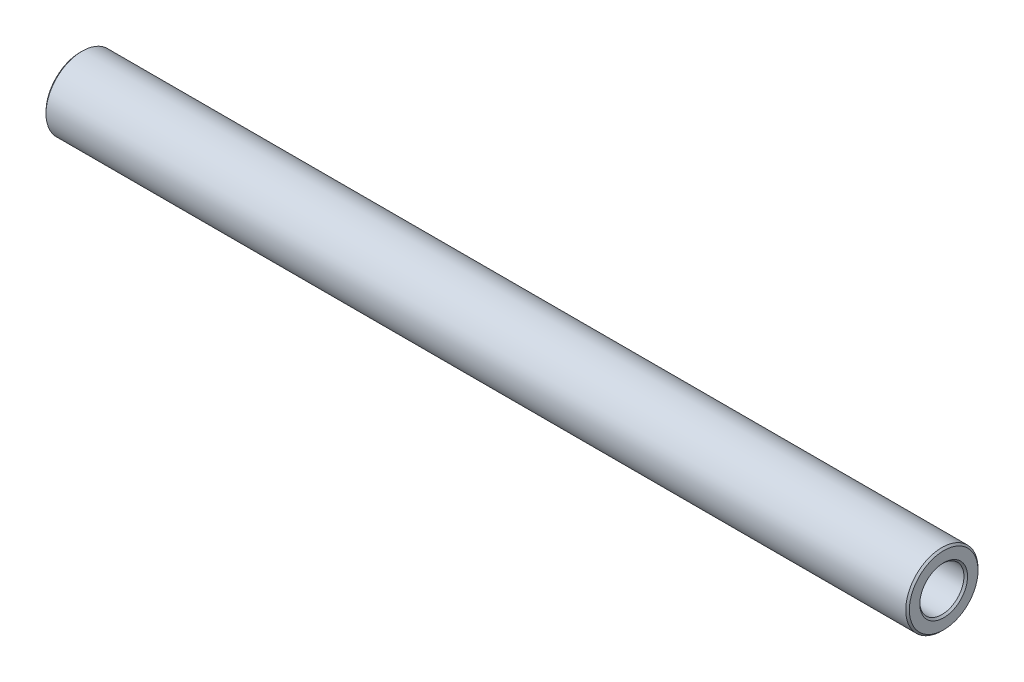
ISO-10303-21;
HEADER;
FILE_DESCRIPTION(('STEP AP214'),'2;1');
FILE_NAME('part.step','',(''),(''),'','','');
FILE_SCHEMA(('AUTOMOTIVE_DESIGN { 1 0 10303 214 1 1 1 1 }'));
ENDSEC;
DATA;
#1=APPLICATION_CONTEXT('core data for automotive mechanical design processes');
#2=APPLICATION_PROTOCOL_DEFINITION('international standard','automotive_design',2000,#1);
#3=PRODUCT_CONTEXT('',#1,'mechanical');
#4=PRODUCT('Part','Part','',(#3));
#5=PRODUCT_RELATED_PRODUCT_CATEGORY('part','',(#4));
#6=PRODUCT_DEFINITION_FORMATION('','',#4);
#7=PRODUCT_DEFINITION_CONTEXT('part definition',#1,'design');
#8=PRODUCT_DEFINITION('design','',#6,#7);
#9=PRODUCT_DEFINITION_SHAPE('','',#8);
#10=(LENGTH_UNIT() NAMED_UNIT(*) SI_UNIT(.MILLI.,.METRE.));
#11=(NAMED_UNIT(*) PLANE_ANGLE_UNIT() SI_UNIT($,.RADIAN.));
#12=(NAMED_UNIT(*) SI_UNIT($,.STERADIAN.) SOLID_ANGLE_UNIT());
#13=UNCERTAINTY_MEASURE_WITH_UNIT(LENGTH_MEASURE(1.E-05),#10,'distance_accuracy_value','');
#14=(GEOMETRIC_REPRESENTATION_CONTEXT(3) GLOBAL_UNCERTAINTY_ASSIGNED_CONTEXT((#13)) GLOBAL_UNIT_ASSIGNED_CONTEXT((#10,
#11,#12)) REPRESENTATION_CONTEXT('',''));
#15=CARTESIAN_POINT('',(0.,0.,0.));
#16=DIRECTION('',(0.,0.,1.));
#17=DIRECTION('',(1.,0.,0.));
#18=AXIS2_PLACEMENT_3D('',#15,#16,#17);
#19=CARTESIAN_POINT('',(119.5,0.,0.));
#20=DIRECTION('',(1.,0.,0.));
#21=DIRECTION('',(0.,0.,-1.));
#22=AXIS2_PLACEMENT_3D('',#19,#20,#21);
#23=PLANE('',#22);
#24=CARTESIAN_POINT('',(119.5,0.,0.));
#25=DIRECTION('',(1.,0.,0.));
#26=DIRECTION('',(0.,0.,-1.));
#27=AXIS2_PLACEMENT_3D('',#24,#25,#26);
#28=CIRCLE('',#27,3.30000000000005);
#29=CARTESIAN_POINT('',(119.5,0.,-3.30000000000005));
#30=VERTEX_POINT('',#29);
#31=EDGE_CURVE('E40',#30,#30,#28,.F.);
#32=ORIENTED_EDGE('',*,*,#31,.T.);
#33=EDGE_LOOP('',(#32));
#34=FACE_BOUND('',#33,.T.);
#35=CARTESIAN_POINT('',(119.5,0.,0.));
#36=DIRECTION('',(1.,0.,0.));
#37=DIRECTION('',(0.,0.,-1.));
#38=AXIS2_PLACEMENT_3D('',#35,#36,#37);
#39=CIRCLE('',#38,4.75000000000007);
#40=CARTESIAN_POINT('',(119.5,0.,-4.75000000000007));
#41=VERTEX_POINT('',#40);
#42=EDGE_CURVE('E44',#41,#41,#39,.T.);
#43=ORIENTED_EDGE('',*,*,#42,.T.);
#44=EDGE_LOOP('',(#43));
#45=FACE_BOUND('',#44,.T.);
#46=ADVANCED_FACE('F29',(#34,#45),#23,.T.);
#47=CARTESIAN_POINT('',(0.,0.,0.));
#48=DIRECTION('',(1.,0.,0.));
#49=DIRECTION('',(0.,0.,-1.));
#50=AXIS2_PLACEMENT_3D('',#47,#48,#49);
#51=PLANE('',#50);
#52=CARTESIAN_POINT('',(0.,0.,0.));
#53=DIRECTION('',(1.,0.,0.));
#54=DIRECTION('',(0.,0.,-1.));
#55=AXIS2_PLACEMENT_3D('',#52,#53,#54);
#56=CIRCLE('',#55,3.3);
#57=CARTESIAN_POINT('',(0.,0.,-3.3));
#58=VERTEX_POINT('',#57);
#59=EDGE_CURVE('E55',#58,#58,#56,.T.);
#60=ORIENTED_EDGE('',*,*,#59,.T.);
#61=EDGE_LOOP('',(#60));
#62=FACE_BOUND('',#61,.T.);
#63=CARTESIAN_POINT('',(0.,0.,0.));
#64=DIRECTION('',(1.,0.,0.));
#65=DIRECTION('',(0.,0.,-1.));
#66=AXIS2_PLACEMENT_3D('',#63,#64,#65);
#67=CIRCLE('',#66,4.74999999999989);
#68=CARTESIAN_POINT('',(0.,0.,-4.74999999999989));
#69=VERTEX_POINT('',#68);
#70=EDGE_CURVE('E58',#69,#69,#67,.F.);
#71=ORIENTED_EDGE('',*,*,#70,.T.);
#72=EDGE_LOOP('',(#71));
#73=FACE_BOUND('',#72,.T.);
#74=ADVANCED_FACE('F62',(#62,#73),#51,.F.);
#75=CARTESIAN_POINT('',(119.5,0.,0.));
#76=DIRECTION('',(-1.,0.,0.));
#77=DIRECTION('',(0.,0.,1.));
#78=AXIS2_PLACEMENT_3D('',#75,#76,#77);
#79=CYLINDRICAL_SURFACE('',#78,5.);
#80=CARTESIAN_POINT('',(0.250000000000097,0.,0.));
#81=DIRECTION('',(1.,0.,0.));
#82=DIRECTION('',(0.,0.,-1.));
#83=AXIS2_PLACEMENT_3D('',#80,#81,#82);
#84=CIRCLE('',#83,5.);
#85=CARTESIAN_POINT('',(0.250000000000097,0.,5.));
#86=VERTEX_POINT('',#85);
#87=EDGE_CURVE('E10',#86,#86,#84,.T.);
#88=CARTESIAN_POINT('',(119.25,0.,0.));
#89=DIRECTION('',(1.,0.,0.));
#90=DIRECTION('',(0.,0.,-1.));
#91=AXIS2_PLACEMENT_3D('',#88,#89,#90);
#92=CIRCLE('',#91,5.);
#93=CARTESIAN_POINT('',(119.25,0.,5.));
#94=VERTEX_POINT('',#93);
#95=EDGE_CURVE('E36',#94,#94,#92,.F.);
#96=CARTESIAN_POINT('',(0.250000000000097,0.,5.));
#97=CARTESIAN_POINT('',(1.48958333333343,0.,5.));
#98=CARTESIAN_POINT('',(2.72916666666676,0.,5.));
#99=CARTESIAN_POINT('',(5.20833333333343,0.,5.));
#100=CARTESIAN_POINT('',(6.44791666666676,0.,5.));
#101=CARTESIAN_POINT('',(8.92708333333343,0.,5.));
#102=CARTESIAN_POINT('',(10.1666666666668,0.,5.));
#103=CARTESIAN_POINT('',(12.6458333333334,0.,5.));
#104=CARTESIAN_POINT('',(13.8854166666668,0.,5.));
#105=CARTESIAN_POINT('',(16.3645833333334,0.,5.));
#106=CARTESIAN_POINT('',(17.6041666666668,0.,5.));
#107=CARTESIAN_POINT('',(20.0833333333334,0.,5.));
#108=CARTESIAN_POINT('',(21.3229166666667,0.,5.));
#109=CARTESIAN_POINT('',(23.8020833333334,0.,5.));
#110=CARTESIAN_POINT('',(25.0416666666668,0.,5.));
#111=CARTESIAN_POINT('',(27.5208333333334,0.,5.));
#112=CARTESIAN_POINT('',(28.7604166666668,0.,5.));
#113=CARTESIAN_POINT('',(31.2395833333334,0.,5.));
#114=CARTESIAN_POINT('',(32.4791666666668,0.,5.));
#115=CARTESIAN_POINT('',(34.9583333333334,0.,5.));
#116=CARTESIAN_POINT('',(36.1979166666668,0.,5.));
#117=CARTESIAN_POINT('',(38.6770833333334,0.,5.));
#118=CARTESIAN_POINT('',(39.9166666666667,0.,5.));
#119=CARTESIAN_POINT('',(42.3958333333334,0.,5.));
#120=CARTESIAN_POINT('',(43.6354166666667,0.,5.));
#121=CARTESIAN_POINT('',(46.1145833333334,0.,5.));
#122=CARTESIAN_POINT('',(47.3541666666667,0.,5.));
#123=CARTESIAN_POINT('',(49.8333333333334,0.,5.));
#124=CARTESIAN_POINT('',(51.0729166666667,0.,5.));
#125=CARTESIAN_POINT('',(53.5520833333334,0.,5.));
#126=CARTESIAN_POINT('',(54.7916666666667,0.,5.));
#127=CARTESIAN_POINT('',(57.2708333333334,0.,5.));
#128=CARTESIAN_POINT('',(58.5104166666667,0.,5.));
#129=CARTESIAN_POINT('',(60.9895833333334,0.,5.));
#130=CARTESIAN_POINT('',(62.2291666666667,0.,5.));
#131=CARTESIAN_POINT('',(64.7083333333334,0.,5.));
#132=CARTESIAN_POINT('',(65.9479166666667,0.,5.));
#133=CARTESIAN_POINT('',(68.4270833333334,0.,5.));
#134=CARTESIAN_POINT('',(69.6666666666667,0.,5.));
#135=CARTESIAN_POINT('',(72.1458333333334,0.,5.));
#136=CARTESIAN_POINT('',(73.3854166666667,0.,5.));
#137=CARTESIAN_POINT('',(75.8645833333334,0.,5.));
#138=CARTESIAN_POINT('',(77.1041666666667,0.,5.));
#139=CARTESIAN_POINT('',(79.5833333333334,0.,5.));
#140=CARTESIAN_POINT('',(80.8229166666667,0.,5.));
#141=CARTESIAN_POINT('',(83.3020833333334,0.,5.));
#142=CARTESIAN_POINT('',(84.5416666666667,0.,5.));
#143=CARTESIAN_POINT('',(87.0208333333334,0.,5.));
#144=CARTESIAN_POINT('',(88.2604166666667,0.,5.));
#145=CARTESIAN_POINT('',(90.7395833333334,0.,5.));
#146=CARTESIAN_POINT('',(91.9791666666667,0.,5.));
#147=CARTESIAN_POINT('',(94.4583333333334,0.,5.));
#148=CARTESIAN_POINT('',(95.6979166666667,0.,5.));
#149=CARTESIAN_POINT('',(98.1770833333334,0.,5.));
#150=CARTESIAN_POINT('',(99.4166666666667,0.,5.));
#151=CARTESIAN_POINT('',(101.895833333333,0.,5.));
#152=CARTESIAN_POINT('',(103.135416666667,0.,5.));
#153=CARTESIAN_POINT('',(105.614583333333,0.,5.));
#154=CARTESIAN_POINT('',(106.854166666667,0.,5.));
#155=CARTESIAN_POINT('',(109.333333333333,0.,5.));
#156=CARTESIAN_POINT('',(110.572916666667,0.,5.));
#157=CARTESIAN_POINT('',(113.052083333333,0.,5.));
#158=CARTESIAN_POINT('',(114.291666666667,0.,5.));
#159=CARTESIAN_POINT('',(116.770833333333,0.,5.));
#160=CARTESIAN_POINT('',(118.010416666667,0.,5.));
#161=CARTESIAN_POINT('',(119.25,0.,5.));
#162=B_SPLINE_CURVE_WITH_KNOTS('',3,(#96,#97,#98,#99,#100,#101,#102,#103,#104,#105,#106,#107,
#108,#109,#110,#111,#112,#113,#114,#115,#116,#117,#118,#119,#120,#121,#122,#123,#124,#125,#126,
#127,#128,#129,#130,#131,#132,#133,#134,#135,#136,#137,#138,#139,#140,#141,#142,#143,#144,#145,
#146,#147,#148,#149,#150,#151,#152,#153,#154,#155,#156,#157,#158,#159,#160,#161),.UNSPECIFIED.,
.F.,.F.,(4,2,2,2,2,2,2,2,2,2,2,2,2,2,2,2,2,2,2,2,2,2,2,2,2,2,2,2,2,2,2,2,4),(0.,
3.71874999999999,7.4375,11.15625,14.875,18.59375,22.3125,26.03125,29.75,33.46875,37.1875,
40.90625,44.625,48.34375,52.0625,55.78125,59.5,63.21875,66.9375,70.65625,74.375,78.09375,
81.8125,85.53125,89.25,92.96875,96.6875,100.40625,104.125,107.84375,111.5625,115.28125,119.),.UNSPECIFIED.);
#163=EDGE_CURVE('BSEAM82',#86,#94,#162,.T.);
#164=ORIENTED_EDGE('',*,*,#87,.T.);
#165=ORIENTED_EDGE('',*,*,#95,.T.);
#166=ORIENTED_EDGE('',*,*,#163,.T.);
#167=ORIENTED_EDGE('',*,*,#163,.F.);
#168=EDGE_LOOP('',(#164,#166,#165,#167));
#169=FACE_BOUND('',#168,.T.);
#170=ADVANCED_FACE('F82',(#169),#79,.T.);
#171=CARTESIAN_POINT('',(119.5,0.,0.));
#172=DIRECTION('',(-1.,0.,0.));
#173=DIRECTION('',(0.,0.,1.));
#174=AXIS2_PLACEMENT_3D('',#171,#172,#173);
#175=CYLINDRICAL_SURFACE('',#174,3.05);
#176=CARTESIAN_POINT('',(0.25,0.,0.));
#177=DIRECTION('',(1.,0.,0.));
#178=DIRECTION('',(0.,0.,-1.));
#179=AXIS2_PLACEMENT_3D('',#176,#177,#178);
#180=CIRCLE('',#179,3.05);
#181=CARTESIAN_POINT('',(0.249999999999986,0.,3.05));
#182=VERTEX_POINT('',#181);
#183=EDGE_CURVE('E49',#182,#182,#180,.F.);
#184=CARTESIAN_POINT('',(119.25,0.,0.));
#185=DIRECTION('',(1.,0.,0.));
#186=DIRECTION('',(0.,0.,-1.));
#187=AXIS2_PLACEMENT_3D('',#184,#185,#186);
#188=CIRCLE('',#187,3.05);
#189=CARTESIAN_POINT('',(119.25,0.,3.05));
#190=VERTEX_POINT('',#189);
#191=EDGE_CURVE('E52',#190,#190,#188,.T.);
#192=CARTESIAN_POINT('',(0.249999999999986,0.,3.05));
#193=CARTESIAN_POINT('',(1.48958333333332,0.,3.05));
#194=CARTESIAN_POINT('',(2.72916666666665,0.,3.05));
#195=CARTESIAN_POINT('',(5.20833333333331,0.,3.05));
#196=CARTESIAN_POINT('',(6.44791666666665,0.,3.05));
#197=CARTESIAN_POINT('',(8.92708333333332,0.,3.05));
#198=CARTESIAN_POINT('',(10.1666666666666,0.,3.05));
#199=CARTESIAN_POINT('',(12.6458333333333,0.,3.05));
#200=CARTESIAN_POINT('',(13.8854166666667,0.,3.05));
#201=CARTESIAN_POINT('',(16.3645833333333,0.,3.05));
#202=CARTESIAN_POINT('',(17.6041666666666,0.,3.05));
#203=CARTESIAN_POINT('',(20.0833333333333,0.,3.05));
#204=CARTESIAN_POINT('',(21.3229166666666,0.,3.05));
#205=CARTESIAN_POINT('',(23.8020833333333,0.,3.05));
#206=CARTESIAN_POINT('',(25.0416666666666,0.,3.05));
#207=CARTESIAN_POINT('',(27.5208333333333,0.,3.05));
#208=CARTESIAN_POINT('',(28.7604166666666,0.,3.05));
#209=CARTESIAN_POINT('',(31.2395833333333,0.,3.05));
#210=CARTESIAN_POINT('',(32.4791666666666,0.,3.05));
#211=CARTESIAN_POINT('',(34.9583333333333,0.,3.05));
#212=CARTESIAN_POINT('',(36.1979166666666,0.,3.05));
#213=CARTESIAN_POINT('',(38.6770833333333,0.,3.05));
#214=CARTESIAN_POINT('',(39.9166666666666,0.,3.05));
#215=CARTESIAN_POINT('',(42.3958333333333,0.,3.05));
#216=CARTESIAN_POINT('',(43.6354166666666,0.,3.05));
#217=CARTESIAN_POINT('',(46.1145833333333,0.,3.05));
#218=CARTESIAN_POINT('',(47.3541666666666,0.,3.05));
#219=CARTESIAN_POINT('',(49.8333333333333,0.,3.05));
#220=CARTESIAN_POINT('',(51.0729166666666,0.,3.05));
#221=CARTESIAN_POINT('',(53.5520833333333,0.,3.05));
#222=CARTESIAN_POINT('',(54.7916666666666,0.,3.05));
#223=CARTESIAN_POINT('',(57.2708333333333,0.,3.05));
#224=CARTESIAN_POINT('',(58.5104166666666,0.,3.05));
#225=CARTESIAN_POINT('',(60.9895833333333,0.,3.05));
#226=CARTESIAN_POINT('',(62.2291666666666,0.,3.05));
#227=CARTESIAN_POINT('',(64.7083333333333,0.,3.05));
#228=CARTESIAN_POINT('',(65.9479166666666,0.,3.05));
#229=CARTESIAN_POINT('',(68.4270833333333,0.,3.05));
#230=CARTESIAN_POINT('',(69.6666666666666,0.,3.05));
#231=CARTESIAN_POINT('',(72.1458333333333,0.,3.05));
#232=CARTESIAN_POINT('',(73.3854166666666,0.,3.05));
#233=CARTESIAN_POINT('',(75.8645833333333,0.,3.05));
#234=CARTESIAN_POINT('',(77.1041666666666,0.,3.05));
#235=CARTESIAN_POINT('',(79.5833333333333,0.,3.05));
#236=CARTESIAN_POINT('',(80.8229166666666,0.,3.05));
#237=CARTESIAN_POINT('',(83.3020833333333,0.,3.05));
#238=CARTESIAN_POINT('',(84.5416666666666,0.,3.05));
#239=CARTESIAN_POINT('',(87.0208333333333,0.,3.05));
#240=CARTESIAN_POINT('',(88.2604166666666,0.,3.05));
#241=CARTESIAN_POINT('',(90.7395833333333,0.,3.05));
#242=CARTESIAN_POINT('',(91.9791666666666,0.,3.05));
#243=CARTESIAN_POINT('',(94.4583333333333,0.,3.05));
#244=CARTESIAN_POINT('',(95.6979166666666,0.,3.05));
#245=CARTESIAN_POINT('',(98.1770833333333,0.,3.05));
#246=CARTESIAN_POINT('',(99.4166666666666,0.,3.05));
#247=CARTESIAN_POINT('',(101.895833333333,0.,3.05));
#248=CARTESIAN_POINT('',(103.135416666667,0.,3.05));
#249=CARTESIAN_POINT('',(105.614583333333,0.,3.05));
#250=CARTESIAN_POINT('',(106.854166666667,0.,3.05));
#251=CARTESIAN_POINT('',(109.333333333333,0.,3.05));
#252=CARTESIAN_POINT('',(110.572916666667,0.,3.05));
#253=CARTESIAN_POINT('',(113.052083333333,0.,3.05));
#254=CARTESIAN_POINT('',(114.291666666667,0.,3.05));
#255=CARTESIAN_POINT('',(116.770833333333,0.,3.05));
#256=CARTESIAN_POINT('',(118.010416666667,0.,3.05));
#257=CARTESIAN_POINT('',(119.25,0.,3.05));
#258=B_SPLINE_CURVE_WITH_KNOTS('',3,(#192,#193,#194,#195,#196,#197,#198,#199,#200,#201,#202,
#203,#204,#205,#206,#207,#208,#209,#210,#211,#212,#213,#214,#215,#216,#217,#218,#219,#220,#221,
#222,#223,#224,#225,#226,#227,#228,#229,#230,#231,#232,#233,#234,#235,#236,#237,#238,#239,#240,
#241,#242,#243,#244,#245,#246,#247,#248,#249,#250,#251,#252,#253,#254,#255,#256,#257),
.UNSPECIFIED.,.F.,.F.,(4,2,2,2,2,2,2,2,2,2,2,2,2,2,2,2,2,2,2,2,2,2,2,2,2,2,2,2,2,2,2,2,4),(0.,
3.71874999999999,7.4375,11.15625,14.875,18.59375,22.3125,26.03125,29.75,33.46875,37.1875,
40.90625,44.625,48.34375,52.0625,55.78125,59.5,63.21875,66.9375,70.65625,74.375,78.09375,
81.8125,85.53125,89.25,92.9687499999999,96.6875,100.40625,104.125,107.84375,111.5625,115.28125,
119.),.UNSPECIFIED.);
#259=EDGE_CURVE('BSEAM87',#182,#190,#258,.T.);
#260=ORIENTED_EDGE('',*,*,#183,.T.);
#261=ORIENTED_EDGE('',*,*,#191,.T.);
#262=ORIENTED_EDGE('',*,*,#259,.T.);
#263=ORIENTED_EDGE('',*,*,#259,.F.);
#264=EDGE_LOOP('',(#260,#262,#261,#263));
#265=FACE_BOUND('',#264,.T.);
#266=ADVANCED_FACE('F87',(#265),#175,.F.);
#267=CARTESIAN_POINT('',(0.,0.,0.));
#268=DIRECTION('',(-1.,0.,0.));
#269=DIRECTION('',(0.,0.,1.));
#270=AXIS2_PLACEMENT_3D('',#267,#268,#269);
#271=CONICAL_SURFACE('',#270,3.3,0.785398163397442);
#272=ORIENTED_EDGE('',*,*,#183,.F.);
#273=EDGE_LOOP('',(#272));
#274=FACE_BOUND('',#273,.T.);
#275=ORIENTED_EDGE('',*,*,#59,.F.);
#276=EDGE_LOOP('',(#275));
#277=FACE_BOUND('',#276,.T.);
#278=ADVANCED_FACE('F73',(#274,#277),#271,.F.);
#279=CARTESIAN_POINT('',(119.25,0.,0.));
#280=DIRECTION('',(1.,0.,0.));
#281=DIRECTION('',(0.,0.,-1.));
#282=AXIS2_PLACEMENT_3D('',#279,#280,#281);
#283=CONICAL_SURFACE('',#282,3.05,0.785398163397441);
#284=ORIENTED_EDGE('',*,*,#31,.F.);
#285=EDGE_LOOP('',(#284));
#286=FACE_BOUND('',#285,.T.);
#287=ORIENTED_EDGE('',*,*,#191,.F.);
#288=EDGE_LOOP('',(#287));
#289=FACE_BOUND('',#288,.T.);
#290=ADVANCED_FACE('F67',(#286,#289),#283,.F.);
#291=CARTESIAN_POINT('',(0.250000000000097,0.,0.));
#292=DIRECTION('',(1.,0.,0.));
#293=DIRECTION('',(0.,0.,-1.));
#294=AXIS2_PLACEMENT_3D('',#291,#292,#293);
#295=CONICAL_SURFACE('',#294,5.,0.785398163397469);
#296=ORIENTED_EDGE('',*,*,#70,.F.);
#297=EDGE_LOOP('',(#296));
#298=FACE_BOUND('',#297,.T.);
#299=ORIENTED_EDGE('',*,*,#87,.F.);
#300=EDGE_LOOP('',(#299));
#301=FACE_BOUND('',#300,.T.);
#302=ADVANCED_FACE('F64',(#298,#301),#295,.T.);
#303=CARTESIAN_POINT('',(119.5,0.,0.));
#304=DIRECTION('',(-1.,0.,0.));
#305=DIRECTION('',(0.,0.,1.));
#306=AXIS2_PLACEMENT_3D('',#303,#304,#305);
#307=CONICAL_SURFACE('',#306,4.75000000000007,0.785398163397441);
#308=ORIENTED_EDGE('',*,*,#95,.F.);
#309=EDGE_LOOP('',(#308));
#310=FACE_BOUND('',#309,.T.);
#311=ORIENTED_EDGE('',*,*,#42,.F.);
#312=EDGE_LOOP('',(#311));
#313=FACE_BOUND('',#312,.T.);
#314=ADVANCED_FACE('F31',(#310,#313),#307,.T.);
#315=CLOSED_SHELL('',(#46,#74,#170,#266,#278,#290,#302,#314));
#316=MANIFOLD_SOLID_BREP('B2',#315);
#317=ADVANCED_BREP_SHAPE_REPRESENTATION('',(#18,#316),#14);
#318=SHAPE_DEFINITION_REPRESENTATION(#9,#317);
ENDSEC;
END-ISO-10303-21;
